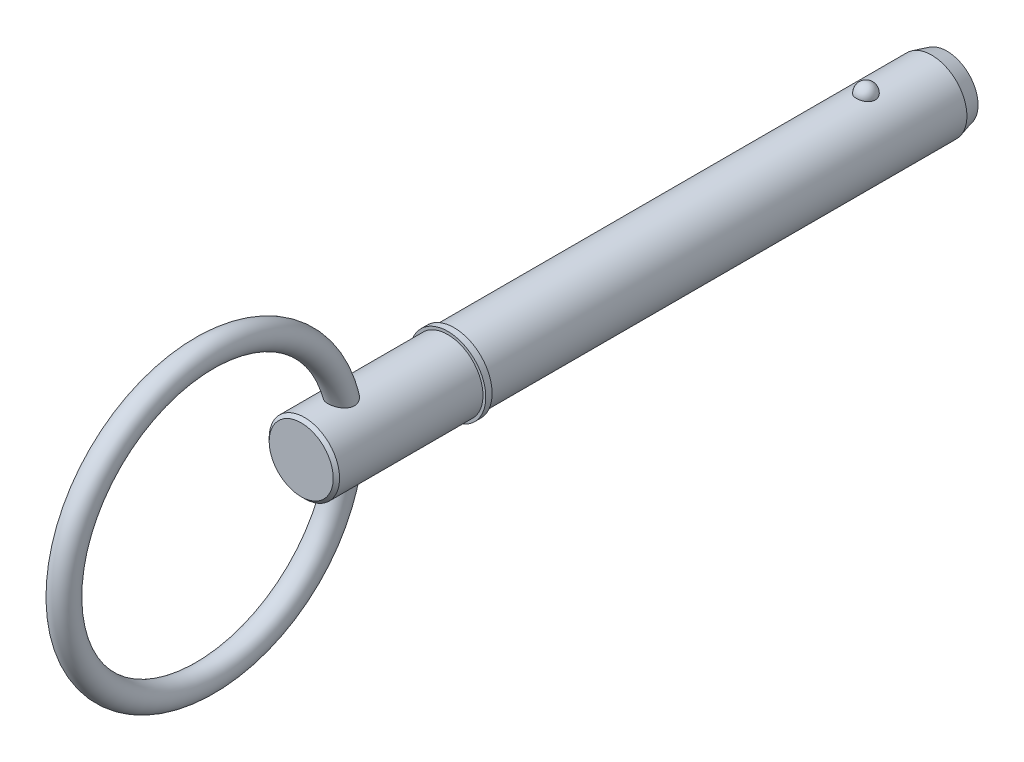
from build123d import *

# Parameters (mm, degrees)
SKETCH2_R           = 5.555
BOSS_EXTRUDE1_DEPTH = 63.5
BOSS_EXTRUDE2_START = 14.27
SKETCH3_R           = 5.555
BOSS_EXTRUDE2_DEPTH = 14.27
CHAMFER1_SIZE       = 2.4
CHAMFER1_SIZE2      = 0.643078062
SKETCH20_W          = 1
SKETCH20_H          = 6
SKETCH21_R          = 5.555
BOSS_EXTRUDE3_DEPTH = 24.13
CHAMFER2_SIZE       = 0.5
SKETCH24_R          = 2


with BuildPart() as part:
    # Sketch2 → Boss-Extrude1 (new body)
    with BuildSketch(Plane.XY):
        Circle(SKETCH2_R)
    extrude(amount=BOSS_EXTRUDE1_DEPTH)

    # Sketch3 → Boss-Extrude2 (add)
    with BuildSketch(Plane(origin=(0, 0, 0), x_dir=(-1, 0, 0), z_dir=(0, 0, -1)).offset(BOSS_EXTRUDE2_START)):
        Circle(SKETCH3_R)
    extrude(amount=-BOSS_EXTRUDE2_DEPTH)

    # Chamfer1
    chamfer1_edges = [part.edges().sort_by_distance(p)[0] for p in [
        (5.555, 0, -14.27),
    ]]
    chamfer1_side = [part.faces().sort_by_distance(p)[0] for p in [
        (5.555, 0, -7.135),
    ]]
    chamfer(chamfer1_edges, length=CHAMFER1_SIZE, length2=CHAMFER1_SIZE2, reference=chamfer1_side[0])

    # Sketch18 → Revolve1 (revolve)
    with BuildSketch(Plane(origin=(0, 0, 0), x_dir=(0, 0, -1), z_dir=(1, 0, 0))):
        with BuildLine():
            Line((1.49, 7.045), (1.49, 4.065))
            ThreePointArc((1.49, 4.065), (0, 5.555), (1.49, 7.045))
        make_face()
    revolve(axis=Axis((0, 7.045, -1.49), (0, -1, 0)))

    # Sketch20 → Revolve2 (revolve)
    with BuildSketch(Plane(origin=(0, 0, 0), x_dir=(0, 0, -1), z_dir=(1, 0, 0)), mode=Mode.PRIVATE) as revolve2_sk:
        with Locations((-64, 3)):
            Rectangle(SKETCH20_W, SKETCH20_H)
    revolve(revolve2_sk.sketch.rotate(Axis((0, 0, 33.728787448), (0, 0, 1)), 90), axis=Axis((0, 0, 33.728787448), (0, 0, 1)))

    # Sketch21 → Boss-Extrude3 (add)
    with BuildSketch(Plane(origin=(0, 0, 63.5), x_dir=(-1, 0, 0), z_dir=(0, 0, -1))):
        Circle(SKETCH21_R)
    extrude(amount=-BOSS_EXTRUDE3_DEPTH)

    # Chamfer2
    chamfer2_edges = [part.edges().sort_by_distance(p)[0] for p in [
        (5.555, 0, 87.63),
    ]]
    chamfer(chamfer2_edges, length=CHAMFER2_SIZE)

    # Sweep1: sweep along a path in Sketch23
    with BuildLine(Plane(origin=(0, 0, 0), x_dir=(0, 0, -1), z_dir=(1, 0, 0))) as sweep1_path:
        CenterArc((-102.855, 0), 22.225, 0, 360)
    # Sketch24 → Sweep1 (sweep)
    with BuildSketch(Plane(origin=(0, 0, 0), x_dir=(1, 0, 0), z_dir=(0, 1, 0))):
        with Locations((0, -80.63)):
            Circle(SKETCH24_R)
    sweep(path=sweep1_path.line)


solid = part.part
